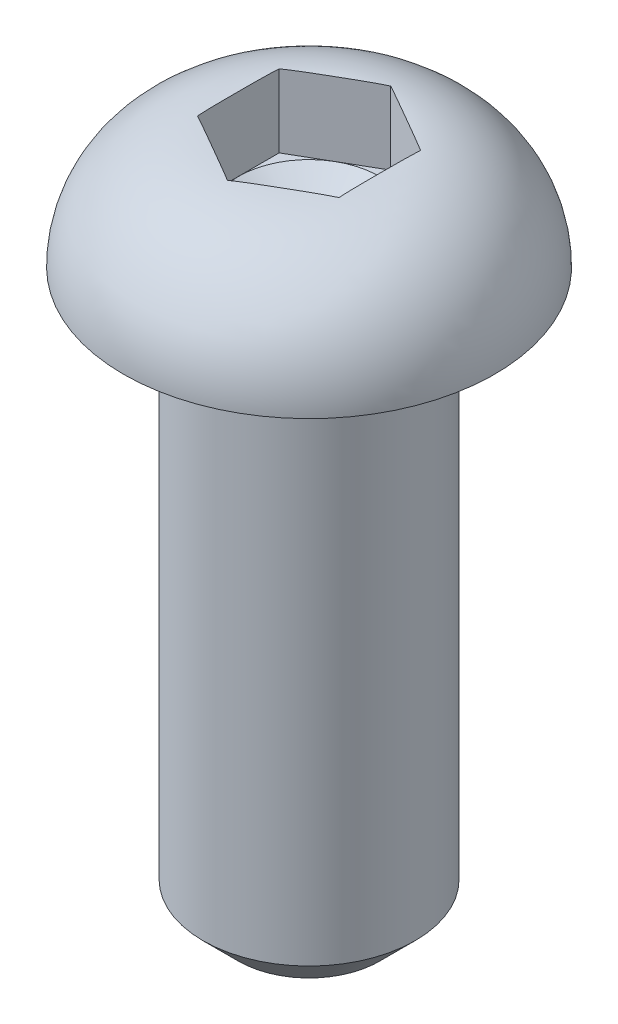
ISO-10303-21;
HEADER;
FILE_DESCRIPTION(('STEP AP214'),'2;1');
FILE_NAME('part.step','',(''),(''),'','','');
FILE_SCHEMA(('AUTOMOTIVE_DESIGN { 1 0 10303 214 1 1 1 1 }'));
ENDSEC;
DATA;
#1=APPLICATION_CONTEXT('core data for automotive mechanical design processes');
#2=APPLICATION_PROTOCOL_DEFINITION('international standard','automotive_design',2000,#1);
#3=PRODUCT_CONTEXT('',#1,'mechanical');
#4=PRODUCT('Part','Part','',(#3));
#5=PRODUCT_RELATED_PRODUCT_CATEGORY('part','',(#4));
#6=PRODUCT_DEFINITION_FORMATION('','',#4);
#7=PRODUCT_DEFINITION_CONTEXT('part definition',#1,'design');
#8=PRODUCT_DEFINITION('design','',#6,#7);
#9=PRODUCT_DEFINITION_SHAPE('','',#8);
#10=(LENGTH_UNIT() NAMED_UNIT(*) SI_UNIT(.MILLI.,.METRE.));
#11=(NAMED_UNIT(*) PLANE_ANGLE_UNIT() SI_UNIT($,.RADIAN.));
#12=(NAMED_UNIT(*) SI_UNIT($,.STERADIAN.) SOLID_ANGLE_UNIT());
#13=UNCERTAINTY_MEASURE_WITH_UNIT(LENGTH_MEASURE(1.E-05),#10,'distance_accuracy_value','');
#14=(GEOMETRIC_REPRESENTATION_CONTEXT(3) GLOBAL_UNCERTAINTY_ASSIGNED_CONTEXT((#13)) GLOBAL_UNIT_ASSIGNED_CONTEXT((#10,
#11,#12)) REPRESENTATION_CONTEXT('',''));
#15=CARTESIAN_POINT('',(0.,0.,0.));
#16=DIRECTION('',(0.,0.,1.));
#17=DIRECTION('',(1.,0.,0.));
#18=AXIS2_PLACEMENT_3D('',#15,#16,#17);
#19=CARTESIAN_POINT('',(-1.473312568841,-15.707490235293,0.698540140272));
#20=DIRECTION('',(0.,-1.,0.));
#21=DIRECTION('',(0.,0.,-1.));
#22=AXIS2_PLACEMENT_3D('',#19,#20,#21);
#23=PLANE('',#22);
#24=CARTESIAN_POINT('',(-1.473312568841,-15.707490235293,0.698540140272));
#25=DIRECTION('',(0.,-1.,0.));
#26=DIRECTION('',(0.,0.,1.));
#27=AXIS2_PLACEMENT_3D('',#24,#25,#26);
#28=CIRCLE('',#27,2.);
#29=CARTESIAN_POINT('',(-1.473312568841,-15.707490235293,2.698540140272));
#30=VERTEX_POINT('',#29);
#31=EDGE_CURVE('E10',#30,#30,#28,.T.);
#32=ORIENTED_EDGE('',*,*,#31,.T.);
#33=EDGE_LOOP('',(#32));
#34=FACE_BOUND('',#33,.T.);
#35=ADVANCED_FACE('F16',(#34),#23,.T.);
#36=CARTESIAN_POINT('',(-1.473312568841,-15.207490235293,0.698540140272));
#37=DIRECTION('',(0.,1.,0.));
#38=DIRECTION('',(0.,0.,-1.));
#39=AXIS2_PLACEMENT_3D('',#36,#37,#38);
#40=CONICAL_SURFACE('',#39,2.5,0.785398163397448);
#41=CARTESIAN_POINT('',(-1.473312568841,-14.707490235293,0.698540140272));
#42=DIRECTION('',(0.,-1.,0.));
#43=DIRECTION('',(0.,0.,1.));
#44=AXIS2_PLACEMENT_3D('',#41,#42,#43);
#45=CIRCLE('',#44,3.);
#46=CARTESIAN_POINT('',(-1.473312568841,-14.707490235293,3.698540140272));
#47=VERTEX_POINT('',#46);
#48=EDGE_CURVE('E25',#47,#47,#45,.T.);
#49=ORIENTED_EDGE('',*,*,#48,.T.);
#50=EDGE_LOOP('',(#49));
#51=FACE_BOUND('',#50,.T.);
#52=ORIENTED_EDGE('',*,*,#31,.F.);
#53=EDGE_LOOP('',(#52));
#54=FACE_BOUND('',#53,.T.);
#55=ADVANCED_FACE('F354',(#51,#54),#40,.T.);
#56=CARTESIAN_POINT('',(-1.473312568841,0.292509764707,0.698540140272));
#57=DIRECTION('',(0.,-1.,0.));
#58=DIRECTION('',(0.,0.,1.));
#59=AXIS2_PLACEMENT_3D('',#56,#57,#58);
#60=CYLINDRICAL_SURFACE('',#59,3.);
#61=CARTESIAN_POINT('',(-1.473312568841,0.042509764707,0.698540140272));
#62=DIRECTION('',(0.,-1.,0.));
#63=DIRECTION('',(0.,0.,1.));
#64=AXIS2_PLACEMENT_3D('',#61,#62,#63);
#65=CIRCLE('',#64,3.);
#66=CARTESIAN_POINT('',(-1.473312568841,0.042509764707,3.698540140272));
#67=VERTEX_POINT('',#66);
#68=EDGE_CURVE('E164',#67,#67,#65,.T.);
#69=ORIENTED_EDGE('',*,*,#68,.T.);
#70=EDGE_LOOP('',(#69));
#71=FACE_BOUND('',#70,.T.);
#72=ORIENTED_EDGE('',*,*,#48,.F.);
#73=EDGE_LOOP('',(#72));
#74=FACE_BOUND('',#73,.T.);
#75=ADVANCED_FACE('F359',(#71,#74),#60,.T.);
#76=CARTESIAN_POINT('',(-1.473312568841,0.042509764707,0.698540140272));
#77=DIRECTION('',(0.,-1.,0.));
#78=DIRECTION('',(0.,0.,1.));
#79=AXIS2_PLACEMENT_3D('',#76,#77,#78);
#80=TOROIDAL_SURFACE('',#79,3.25,0.25);
#81=CARTESIAN_POINT('',(-1.473312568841,0.292509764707,0.698540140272));
#82=DIRECTION('',(0.,-1.,0.));
#83=DIRECTION('',(0.,0.,1.));
#84=AXIS2_PLACEMENT_3D('',#81,#82,#83);
#85=CIRCLE('',#84,3.25);
#86=CARTESIAN_POINT('',(-1.473312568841,0.292509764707,3.948540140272));
#87=VERTEX_POINT('',#86);
#88=EDGE_CURVE('E165',#87,#87,#85,.T.);
#89=ORIENTED_EDGE('',*,*,#88,.T.);
#90=EDGE_LOOP('',(#89));
#91=FACE_BOUND('',#90,.T.);
#92=ORIENTED_EDGE('',*,*,#68,.F.);
#93=EDGE_LOOP('',(#92));
#94=FACE_BOUND('',#93,.T.);
#95=ADVANCED_FACE('F391',(#91,#94),#80,.F.);
#96=CARTESIAN_POINT('',(-1.473312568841,0.292509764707,0.698540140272));
#97=DIRECTION('',(0.,-1.,0.));
#98=DIRECTION('',(0.,0.,-1.));
#99=AXIS2_PLACEMENT_3D('',#96,#97,#98);
#100=PLANE('',#99);
#101=ORIENTED_EDGE('',*,*,#88,.F.);
#102=EDGE_LOOP('',(#101));
#103=FACE_BOUND('',#102,.T.);
#104=CARTESIAN_POINT('',(-1.473312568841,0.292509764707,0.698540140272));
#105=DIRECTION('',(0.,-1.,0.));
#106=DIRECTION('',(0.,0.,1.));
#107=AXIS2_PLACEMENT_3D('',#104,#105,#106);
#108=CIRCLE('',#107,5.25);
#109=CARTESIAN_POINT('',(-1.473312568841,0.292509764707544,5.948540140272));
#110=VERTEX_POINT('',#109);
#111=EDGE_CURVE('E128',#110,#110,#108,.T.);
#112=ORIENTED_EDGE('',*,*,#111,.T.);
#113=EDGE_LOOP('',(#112));
#114=FACE_BOUND('',#113,.T.);
#115=ADVANCED_FACE('F396',(#103,#114),#100,.T.);
#116=CARTESIAN_POINT('',(-1.473312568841,0.292509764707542,0.698540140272));
#117=DIRECTION('',(0.,-1.,0.));
#118=DIRECTION('',(0.,0.,1.));
#119=AXIS2_PLACEMENT_3D('',#116,#117,#118);
#120=DEGENERATE_TOROIDAL_SURFACE('',#119,1.95000000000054,3.29999999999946,.T.);
#121=CARTESIAN_POINT('',(0.52668743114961,3.57288030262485,1.85324067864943));
#122=CARTESIAN_POINT('',(0.50395887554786,3.57431799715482,1.86636301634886));
#123=CARTESIAN_POINT('',(0.45872047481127,3.57694780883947,1.89248141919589));
#124=CARTESIAN_POINT('',(0.39102821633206,3.58025582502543,1.9315635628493));
#125=CARTESIAN_POINT('',(0.32366460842,3.58298954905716,1.97045596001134));
#126=CARTESIAN_POINT('',(0.25643296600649,3.58522307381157,2.00927216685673));
#127=CARTESIAN_POINT('',(0.18702223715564,3.58708050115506,2.04934646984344));
#128=CARTESIAN_POINT('',(0.11309430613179,3.58862439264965,2.09202878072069));
#129=CARTESIAN_POINT('',(0.0228453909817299,3.59002196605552,2.14413401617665));
#130=CARTESIAN_POINT('',(-0.08109908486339,3.59106001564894,2.2041463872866));
#131=CARTESIAN_POINT('',(-0.19619270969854,3.59170078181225,2.27059572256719));
#132=CARTESIAN_POINT('',(-0.30515493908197,3.59200299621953,2.33350509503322));
#133=CARTESIAN_POINT('',(-0.39744455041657,3.59211331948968,2.38678852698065));
#134=CARTESIAN_POINT('',(-0.4600240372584,3.59213369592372,2.42291881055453));
#135=CARTESIAN_POINT('',(-0.517371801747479,3.59212641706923,2.45602855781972));
#136=CARTESIAN_POINT('',(-0.580095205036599,3.59208466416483,2.49224193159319));
#137=CARTESIAN_POINT('',(-0.6613487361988,3.59195025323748,2.53915367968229));
#138=CARTESIAN_POINT('',(-0.741936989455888,3.59170752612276,2.58568132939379));
#139=CARTESIAN_POINT('',(-0.815376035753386,3.59134622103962,2.62808138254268));
#140=CARTESIAN_POINT('',(-0.881760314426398,3.59086755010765,2.6664083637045));
#141=CARTESIAN_POINT('',(-0.941225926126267,3.59029424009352,2.70074085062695));
#142=CARTESIAN_POINT('',(-1.00053877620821,3.5895476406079,2.73498514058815));
#143=CARTESIAN_POINT('',(-1.05974912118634,3.58859477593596,2.76917024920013));
#144=CARTESIAN_POINT('',(-1.11893997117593,3.58739902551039,2.80334410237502));
#145=CARTESIAN_POINT('',(-1.17808805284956,3.58592335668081,2.83749326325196));
#146=CARTESIAN_POINT('',(-1.23710928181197,3.58413198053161,2.87156918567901));
#147=CARTESIAN_POINT('',(-1.29599394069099,3.58198776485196,2.90556625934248));
#148=CARTESIAN_POINT('',(-1.35487552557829,3.57944706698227,2.93956155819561));
#149=CARTESIAN_POINT('',(-1.41398005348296,3.57645683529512,2.97368557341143));
#150=CARTESIAN_POINT('',(-1.45348463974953,3.5741345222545,2.99649355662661));
#151=CARTESIAN_POINT('',(-1.473312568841,3.57288030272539,3.0079412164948));
#152=(BOUNDED_CURVE() B_SPLINE_CURVE(3,(#121,#122,#123,#124,#125,#126,#127,#128,#129,#130,#131,
#132,#133,#134,#135,#136,#137,#138,#139,#140,#141,#142,#143,#144,#145,#146,#147,#148,#149,#150,
#151),.UNSPECIFIED.,.F.,.F.) B_SPLINE_CURVE_WITH_KNOTS((4,1,1,1,1,1,1,1,1,1,1,1,1,1,1,1,1,1,1,1,
1,1,1,1,1,1,1,1,4),(-1.,-0.96587938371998,-0.932094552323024,-0.89840966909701,
-0.864799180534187,-0.831226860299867,-0.794285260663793,-0.753909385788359,-0.695866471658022,
-0.638392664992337,-0.581300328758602,-0.532463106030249,-0.499998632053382,-0.487460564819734,
-0.446468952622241,-0.405943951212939,-0.365618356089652,-0.325621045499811,-0.295811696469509,
-0.266061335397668,-0.236436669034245,-0.206853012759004,-0.177252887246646,-0.147652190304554,
-0.118125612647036,-0.0887070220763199,-0.0593007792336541,-0.0297668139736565,0.),
.UNSPECIFIED.) CURVE() GEOMETRIC_REPRESENTATION_ITEM() RATIONAL_B_SPLINE_CURVE((1.,1.,1.,1.,1.,
1.,1.,1.,1.,1.,1.,1.,1.,1.,1.,1.,1.,1.,1.,1.,1.,1.,1.,1.,1.,1.,1.,1.,1.,1.,1.)) REPRESENTATION_ITEM(''));
#153=CARTESIAN_POINT('',(0.526687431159,3.57288030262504,1.85324067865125));
#154=VERTEX_POINT('',#153);
#155=CARTESIAN_POINT('',(-1.473312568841,3.57288030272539,3.0079412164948));
#156=VERTEX_POINT('',#155);
#157=EDGE_CURVE('E115',#154,#156,#152,.T.);
#158=ORIENTED_EDGE('',*,*,#157,.T.);
#159=CARTESIAN_POINT('',(-1.473312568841,3.57288030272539,3.0079412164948));
#160=CARTESIAN_POINT('',(-1.49930551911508,3.57452446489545,2.99293418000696));
#161=CARTESIAN_POINT('',(-1.54669386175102,3.57724438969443,2.96557450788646));
#162=CARTESIAN_POINT('',(-1.61136203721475,3.58033769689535,2.92823831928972));
#163=CARTESIAN_POINT('',(-1.66780393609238,3.58263941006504,2.89565157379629));
#164=CARTESIAN_POINT('',(-1.72254887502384,3.58455185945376,2.86404456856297));
#165=CARTESIAN_POINT('',(-1.78116746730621,3.58626798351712,2.83020110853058));
#166=CARTESIAN_POINT('',(-1.84563780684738,3.5878028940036,2.79297914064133));
#167=CARTESIAN_POINT('',(-1.9149890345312,3.5890939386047,2.75293919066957));
#168=CARTESIAN_POINT('',(-1.99046837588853,3.5901463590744,2.70936117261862));
#169=CARTESIAN_POINT('',(-2.07143634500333,3.59094566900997,2.66261429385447));
#170=CARTESIAN_POINT('',(-2.159462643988,3.59151654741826,2.6117922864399));
#171=CARTESIAN_POINT('',(-2.25264269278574,3.59187609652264,2.55799476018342));
#172=CARTESIAN_POINT('',(-2.35078356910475,3.5920726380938,2.50133309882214));
#173=CARTESIAN_POINT('',(-2.42460405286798,3.5921263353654,2.45871282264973));
#174=CARTESIAN_POINT('',(-2.493521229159,3.59213400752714,2.41892347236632));
#175=CARTESIAN_POINT('',(-2.56411379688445,3.59210500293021,2.37816683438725));
#176=CARTESIAN_POINT('',(-2.66310210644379,3.59195989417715,2.32101590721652));
#177=CARTESIAN_POINT('',(-2.76994014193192,3.59161157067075,2.25933293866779));
#178=CARTESIAN_POINT('',(-2.87591146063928,3.59096579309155,2.19815036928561));
#179=CARTESIAN_POINT('',(-2.98021206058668,3.58989201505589,2.13793238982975));
#180=CARTESIAN_POINT('',(-3.08268055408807,3.58824546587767,2.07877217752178));
#181=CARTESIAN_POINT('',(-3.18291131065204,3.58588753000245,2.02090392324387));
#182=CARTESIAN_POINT('',(-3.28127518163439,3.58267093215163,1.96411351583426));
#183=CARTESIAN_POINT('',(-3.37778177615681,3.57846725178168,1.90839540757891));
#184=CARTESIAN_POINT('',(-3.4416346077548,3.57488401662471,1.87152995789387));
#185=CARTESIAN_POINT('',(-3.47331256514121,3.57288030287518,1.85324068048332));
#186=(BOUNDED_CURVE() B_SPLINE_CURVE(3,(#159,#160,#161,#162,#163,#164,#165,#166,#167,#168,#169,
#170,#171,#172,#173,#174,#175,#176,#177,#178,#179,#180,#181,#182,#183,#184,#185),.UNSPECIFIED.,
.F.,.F.) B_SPLINE_CURVE_WITH_KNOTS((4,1,1,1,1,1,1,1,1,1,1,1,1,1,1,1,1,1,1,1,1,1,1,1,4),(0.,
0.0390048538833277,0.0711123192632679,0.0970451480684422,0.123705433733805,0.153266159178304,
0.185007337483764,0.220437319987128,0.257302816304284,0.298208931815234,0.341849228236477,
0.389286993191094,0.437920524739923,0.489014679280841,0.499990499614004,0.54127223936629,
0.594879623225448,0.648437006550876,0.70148083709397,0.753789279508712,0.804852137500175,
0.85516576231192,0.904141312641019,0.952434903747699,1.),
.UNSPECIFIED.) CURVE() GEOMETRIC_REPRESENTATION_ITEM() RATIONAL_B_SPLINE_CURVE((1.,1.,1.,1.,1.,
1.,1.,1.,1.,1.,1.,1.,1.,1.,1.,1.,1.,1.,1.,1.,1.,1.,1.,1.,1.,1.,1.)) REPRESENTATION_ITEM(''));
#187=CARTESIAN_POINT('',(-3.473312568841,3.57288030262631,1.85324067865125));
#188=VERTEX_POINT('',#187);
#189=EDGE_CURVE('E120',#156,#188,#186,.T.);
#190=ORIENTED_EDGE('',*,*,#189,.T.);
#191=CARTESIAN_POINT('',(-3.47331256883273,3.57288030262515,1.85324067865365));
#192=CARTESIAN_POINT('',(-3.47331256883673,3.57323324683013,1.84679785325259));
#193=CARTESIAN_POINT('',(-3.47331256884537,3.57444412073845,1.82424537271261));
#194=CARTESIAN_POINT('',(-3.47331256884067,3.57577680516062,1.7975728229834));
#195=CARTESIAN_POINT('',(-3.47331256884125,3.57769538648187,1.75658858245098));
#196=CARTESIAN_POINT('',(-3.473312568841,3.57894443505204,1.72754217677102));
#197=CARTESIAN_POINT('',(-3.473312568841,3.58034958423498,1.69195308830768));
#198=CARTESIAN_POINT('',(-3.473312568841,3.5812636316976,1.66753115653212));
#199=CARTESIAN_POINT('',(-3.473312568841,3.58228054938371,1.63826545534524));
#200=CARTESIAN_POINT('',(-3.473312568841,3.58326058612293,1.60800596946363));
#201=CARTESIAN_POINT('',(-3.473312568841,3.58424381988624,1.57509591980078));
#202=CARTESIAN_POINT('',(-3.473312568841,3.58502540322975,1.54629131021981));
#203=CARTESIAN_POINT('',(-3.473312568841,3.58566018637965,1.52118460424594));
#204=CARTESIAN_POINT('',(-3.473312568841,3.5862197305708,1.49780436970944));
#205=CARTESIAN_POINT('',(-3.473312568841,3.5868647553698,1.46858496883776));
#206=CARTESIAN_POINT('',(-3.473312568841,3.58753158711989,1.43534184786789));
#207=CARTESIAN_POINT('',(-3.473312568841,3.58817496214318,1.39967684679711));
#208=CARTESIAN_POINT('',(-3.473312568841,3.5888932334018,1.35474166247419));
#209=CARTESIAN_POINT('',(-3.473312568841,3.58963515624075,1.29973488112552));
#210=CARTESIAN_POINT('',(-3.473312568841,3.59026641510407,1.2408741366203));
#211=CARTESIAN_POINT('',(-3.473312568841,3.59066209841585,1.19473451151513));
#212=CARTESIAN_POINT('',(-3.473312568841,3.59104616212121,1.14295863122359));
#213=CARTESIAN_POINT('',(-3.473312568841,3.59144454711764,1.07480911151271));
#214=CARTESIAN_POINT('',(-3.473312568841,3.59181857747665,0.975183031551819));
#215=CARTESIAN_POINT('',(-3.473312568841,3.5920414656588,0.865230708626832));
#216=CARTESIAN_POINT('',(-3.473312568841,3.59212006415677,0.771144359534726));
#217=CARTESIAN_POINT('',(-3.473312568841,3.59213278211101,0.706530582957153));
#218=CARTESIAN_POINT('',(-3.473312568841,3.59212861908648,0.667041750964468));
#219=CARTESIAN_POINT('',(-3.473312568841,3.59210530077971,0.602571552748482));
#220=CARTESIAN_POINT('',(-3.473312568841,3.59200545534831,0.503662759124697));
#221=CARTESIAN_POINT('',(-3.473312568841,3.59165590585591,0.362709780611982));
#222=CARTESIAN_POINT('',(-3.473312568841,3.59087015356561,0.21233431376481));
#223=CARTESIAN_POINT('',(-3.473312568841,3.58975658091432,0.104627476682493));
#224=CARTESIAN_POINT('',(-3.473312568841,3.58829371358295,0.00128660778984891));
#225=CARTESIAN_POINT('',(-3.47331256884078,3.58666821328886,-0.089421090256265));
#226=CARTESIAN_POINT('',(-3.47331256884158,3.58319960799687,-0.218458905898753));
#227=CARTESIAN_POINT('',(-3.47331256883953,3.58000957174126,-0.30589057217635));
#228=CARTESIAN_POINT('',(-3.47331256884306,3.57655568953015,-0.38525023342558));
#229=CARTESIAN_POINT('',(-3.47331256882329,3.57457741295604,-0.42518023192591));
#230=CARTESIAN_POINT('',(-3.4733125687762,3.57288030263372,-0.45616039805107));
#231=(BOUNDED_CURVE() B_SPLINE_CURVE(3,(#191,#192,#193,#194,#195,#196,#197,#198,#199,#200,#201,
#202,#203,#204,#205,#206,#207,#208,#209,#210,#211,#212,#213,#214,#215,#216,#217,#218,#219,#220,
#221,#222,#223,#224,#225,#226,#227,#228,#229,#230),.UNSPECIFIED.,.F.,
.F.) B_SPLINE_CURVE_WITH_KNOTS((4,1,1,1,1,1,1,1,1,1,1,1,1,1,1,1,1,1,1,1,1,1,1,1,1,1,1,1,1,1,1,1,
1,1,1,1,1,4),(0.,0.00838688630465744,0.0293500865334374,0.0346853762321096,0.0616603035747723,
0.067088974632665,0.080924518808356,0.0933909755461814,0.105116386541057,0.12024597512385,
0.136158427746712,0.142548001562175,0.152870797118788,0.166538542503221,0.180512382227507,
0.196057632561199,0.21286641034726,0.238876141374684,0.26749560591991,0.289303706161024,
0.298791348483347,0.334729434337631,0.377799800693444,0.428168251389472,0.477523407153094,
0.499994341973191,0.512087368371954,0.528810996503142,0.583727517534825,0.640548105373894,
0.711867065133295,0.779019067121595,0.780436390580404,0.846095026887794,0.896846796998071,
0.948089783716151,0.959718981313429,1.),
.UNSPECIFIED.) CURVE() GEOMETRIC_REPRESENTATION_ITEM() RATIONAL_B_SPLINE_CURVE((1.,1.,1.,1.,1.,
1.,1.,1.,1.,1.,1.,1.,1.,1.,1.,1.,1.,1.,1.,1.,1.,1.,1.,1.,1.,1.,1.,1.,1.,1.,1.,1.,1.,1.,1.,1.,1.,
1.,1.,1.)) REPRESENTATION_ITEM(''));
#232=CARTESIAN_POINT('',(-3.473312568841,3.57288030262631,-0.45616039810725));
#233=VERTEX_POINT('',#232);
#234=EDGE_CURVE('E150',#188,#233,#231,.T.);
#235=ORIENTED_EDGE('',*,*,#234,.T.);
#236=CARTESIAN_POINT('',(-3.47331256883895,3.57288030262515,-0.45616039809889));
#237=CARTESIAN_POINT('',(-3.4502369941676,3.5743401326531,-0.46948308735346));
#238=CARTESIAN_POINT('',(-3.40917274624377,3.57672393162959,-0.49319154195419));
#239=CARTESIAN_POINT('',(-3.35523236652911,3.57940235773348,-0.52433403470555));
#240=CARTESIAN_POINT('',(-3.31610155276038,3.58111845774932,-0.54692622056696));
#241=CARTESIAN_POINT('',(-3.28713856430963,3.58228054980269,-0.5636480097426));
#242=CARTESIAN_POINT('',(-3.26093308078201,3.58326058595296,-0.5787777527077));
#243=CARTESIAN_POINT('',(-3.23243214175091,3.58424382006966,-0.59523277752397));
#244=CARTESIAN_POINT('',(-3.20060720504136,3.58524094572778,-0.61360691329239));
#245=CARTESIAN_POINT('',(-3.16975459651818,3.58611116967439,-0.63141967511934));
#246=CARTESIAN_POINT('',(-3.14019095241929,3.58686475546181,-0.64848825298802));
#247=CARTESIAN_POINT('',(-3.11140156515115,3.58753158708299,-0.66510981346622));
#248=CARTESIAN_POINT('',(-3.08051476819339,3.58817496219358,-0.68294231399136));
#249=CARTESIAN_POINT('',(-3.04159975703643,3.58889323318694,-0.70540990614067));
#250=CARTESIAN_POINT('',(-2.99396248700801,3.58963515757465,-0.73291329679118));
#251=CARTESIAN_POINT('',(-2.93666041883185,3.59034476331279,-0.76599666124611));
#252=CARTESIAN_POINT('',(-2.87273438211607,3.59094797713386,-0.80290437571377));
#253=CARTESIAN_POINT('',(-2.79917105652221,3.59144455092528,-0.84537618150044));
#254=CARTESIAN_POINT('',(-2.71289234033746,3.59181857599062,-0.89518922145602));
#255=CARTESIAN_POINT('',(-2.61767083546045,3.59204146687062,-0.95016538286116));
#256=CARTESIAN_POINT('',(-2.5361896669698,3.59212006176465,-0.99720855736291));
#257=CARTESIAN_POINT('',(-2.46908119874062,3.5921353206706,-1.03595364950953));
#258=CARTESIAN_POINT('',(-2.39826495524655,3.59211470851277,-1.07683942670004));
#259=CARTESIAN_POINT('',(-2.30454380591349,3.59200545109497,-1.13094935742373));
#260=CARTESIAN_POINT('',(-2.18247494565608,3.59165591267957,-1.2014258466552));
#261=CARTESIAN_POINT('',(-2.05130083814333,3.59086442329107,-1.2771592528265));
#262=CARTESIAN_POINT('',(-1.91424320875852,3.58922001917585,-1.35628951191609));
#263=CARTESIAN_POINT('',(-1.79091812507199,3.58666823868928,-1.4274912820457));
#264=CARTESIAN_POINT('',(-1.67916809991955,3.58319958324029,-1.49201018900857));
#265=CARTESIAN_POINT('',(-1.57660712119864,3.57887874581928,-1.55122379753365));
#266=CARTESIAN_POINT('',(-1.50788793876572,3.5750672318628,-1.59089883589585));
#267=CARTESIAN_POINT('',(-1.47331256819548,3.57288030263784,-1.61086093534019));
#268=(BOUNDED_CURVE() B_SPLINE_CURVE(3,(#236,#237,#238,#239,#240,#241,#242,#243,#244,#245,#246,
#247,#248,#249,#250,#251,#252,#253,#254,#255,#256,#257,#258,#259,#260,#261,#262,#263,#264,#265,
#266,#267),.UNSPECIFIED.,.F.,.F.) B_SPLINE_CURVE_WITH_KNOTS((4,1,1,1,1,1,1,1,1,1,1,1,1,1,1,1,1,
1,1,1,1,1,1,1,1,1,1,1,1,4),(0.,0.0346853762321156,0.0616603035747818,0.0809245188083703,
0.0933909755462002,0.10511638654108,0.120245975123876,0.136158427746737,0.152870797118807,
0.166538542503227,0.180512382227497,0.196057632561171,0.212866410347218,0.238876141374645,
0.267495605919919,0.298791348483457,0.334729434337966,0.377799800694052,0.428168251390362,
0.477523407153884,0.499994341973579,0.528810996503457,0.583727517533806,0.640548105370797,
0.711867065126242,0.780436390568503,0.846095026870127,0.896846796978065,0.948089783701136,1.),
.UNSPECIFIED.) CURVE() GEOMETRIC_REPRESENTATION_ITEM() RATIONAL_B_SPLINE_CURVE((1.,1.,1.,1.,1.,
1.,1.,1.,1.,1.,1.,1.,1.,1.,1.,1.,1.,1.,1.,1.,1.,1.,1.,1.,1.,1.,1.,1.,1.,1.,1.,1.)) REPRESENTATION_ITEM(''));
#269=CARTESIAN_POINT('',(-1.473312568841,3.57288030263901,-1.6108609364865));
#270=VERTEX_POINT('',#269);
#271=EDGE_CURVE('E183',#233,#270,#268,.T.);
#272=ORIENTED_EDGE('',*,*,#271,.T.);
#273=CARTESIAN_POINT('',(-1.47331256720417,3.57288030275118,-1.61086093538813));
#274=CARTESIAN_POINT('',(-1.45023699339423,3.57434013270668,-1.59753824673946));
#275=CARTESIAN_POINT('',(-1.40917274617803,3.57672393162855,-1.57382979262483));
#276=CARTESIAN_POINT('',(-1.35523236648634,3.57940235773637,-1.54268729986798));
#277=CARTESIAN_POINT('',(-1.31610155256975,3.58111845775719,-1.52009511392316));
#278=CARTESIAN_POINT('',(-1.28713856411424,3.58228054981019,-1.50337332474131));
#279=CARTESIAN_POINT('',(-1.26093308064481,3.58326058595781,-1.48824358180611));
#280=CARTESIAN_POINT('',(-1.23243214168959,3.58424382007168,-1.47178855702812));
#281=CARTESIAN_POINT('',(-1.20060720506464,3.58524094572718,-1.45341442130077));
#282=CARTESIAN_POINT('',(-1.1697545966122,3.58611116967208,-1.43560165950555));
#283=CARTESIAN_POINT('',(-1.14019095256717,3.58686475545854,-1.41853308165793));
#284=CARTESIAN_POINT('',(-1.11140156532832,3.5875315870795,-1.40191152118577));
#285=CARTESIAN_POINT('',(-1.08051476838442,3.58817496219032,-1.3840790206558));
#286=CARTESIAN_POINT('',(-1.04159975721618,3.58889323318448,-1.3616114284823));
#287=CARTESIAN_POINT('',(-0.993962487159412,3.5896351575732,-1.33410803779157));
#288=CARTESIAN_POINT('',(-0.936660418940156,3.5903447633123,-1.30102467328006));
#289=CARTESIAN_POINT('',(-0.872734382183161,3.59094797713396,-1.26411695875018));
#290=CARTESIAN_POINT('',(-0.799171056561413,3.5914445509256,-1.22164515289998));
#291=CARTESIAN_POINT('',(-0.712892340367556,3.59181857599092,-1.17183211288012));
#292=CARTESIAN_POINT('',(-0.617670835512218,3.59204146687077,-1.11685595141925));
#293=CARTESIAN_POINT('',(-0.536189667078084,3.59212006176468,-1.06981277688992));
#294=CARTESIAN_POINT('',(-0.46908119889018,3.59213532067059,-1.03106768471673));
#295=CARTESIAN_POINT('',(-0.39826495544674,3.59211470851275,-0.99018190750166));
#296=CARTESIAN_POINT('',(-0.30454380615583,3.59200545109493,-0.9360719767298));
#297=CARTESIAN_POINT('',(-0.18247494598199,3.59165591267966,-0.86559548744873));
#298=CARTESIAN_POINT('',(-0.0513008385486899,3.59086442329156,-0.78986208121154));
#299=CARTESIAN_POINT('',(0.0857567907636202,3.58922001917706,-0.7107318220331));
#300=CARTESIAN_POINT('',(0.20908187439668,3.58666823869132,-0.63953005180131));
#301=CARTESIAN_POINT('',(0.32083189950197,3.58319958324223,-0.57501114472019));
#302=CARTESIAN_POINT('',(0.42339287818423,3.57887874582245,-0.51579753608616));
#303=CARTESIAN_POINT('',(0.49211206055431,3.57506723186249,-0.47612249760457));
#304=CARTESIAN_POINT('',(0.52668743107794,3.57288030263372,-0.45616039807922));
#305=(BOUNDED_CURVE() B_SPLINE_CURVE(3,(#273,#274,#275,#276,#277,#278,#279,#280,#281,#282,#283,
#284,#285,#286,#287,#288,#289,#290,#291,#292,#293,#294,#295,#296,#297,#298,#299,#300,#301,#302,
#303,#304),.UNSPECIFIED.,.F.,.F.) B_SPLINE_CURVE_WITH_KNOTS((4,1,1,1,1,1,1,1,1,1,1,1,1,1,1,1,1,
1,1,1,1,1,1,1,1,1,1,1,1,4),(0.,0.0346853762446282,0.0616603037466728,0.0809245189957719,
0.0933909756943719,0.105116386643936,0.120245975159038,0.136158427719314,0.152870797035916,
0.166538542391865,0.180512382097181,0.196057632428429,0.212866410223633,0.238876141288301,
0.267495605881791,0.298791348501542,0.334729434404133,0.37779980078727,0.428168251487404,
0.477523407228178,0.499994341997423,0.52881099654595,0.583727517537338,0.640548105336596,
0.711867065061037,0.780436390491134,0.84609502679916,0.896846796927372,0.948089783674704,1.),
.UNSPECIFIED.) CURVE() GEOMETRIC_REPRESENTATION_ITEM() RATIONAL_B_SPLINE_CURVE((1.,1.,1.,1.,1.,
1.,1.,1.,1.,1.,1.,1.,1.,1.,1.,1.,1.,1.,1.,1.,1.,1.,1.,1.,1.,1.,1.,1.,1.,1.,1.,1.)) REPRESENTATION_ITEM(''));
#306=CARTESIAN_POINT('',(0.526687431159,3.57288030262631,-0.45616039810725));
#307=VERTEX_POINT('',#306);
#308=EDGE_CURVE('E178',#270,#307,#305,.T.);
#309=ORIENTED_EDGE('',*,*,#308,.T.);
#310=CARTESIAN_POINT('',(0.52668743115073,3.57288030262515,-0.45616039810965));
#311=CARTESIAN_POINT('',(0.52668743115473,3.57323324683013,-0.44971757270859));
#312=CARTESIAN_POINT('',(0.52668743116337,3.57444412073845,-0.42716509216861));
#313=CARTESIAN_POINT('',(0.52668743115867,3.57577680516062,-0.40049254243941));
#314=CARTESIAN_POINT('',(0.52668743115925,3.57769538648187,-0.35950830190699));
#315=CARTESIAN_POINT('',(0.526687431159,3.57894443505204,-0.33046189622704));
#316=CARTESIAN_POINT('',(0.526687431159,3.58034958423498,-0.294872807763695));
#317=CARTESIAN_POINT('',(0.526687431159,3.5812636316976,-0.270450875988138));
#318=CARTESIAN_POINT('',(0.526687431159,3.58228054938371,-0.241185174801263));
#319=CARTESIAN_POINT('',(0.526687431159,3.58326058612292,-0.210925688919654));
#320=CARTESIAN_POINT('',(0.526687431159,3.58424381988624,-0.178015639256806));
#321=CARTESIAN_POINT('',(0.526687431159,3.58502540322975,-0.14921102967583));
#322=CARTESIAN_POINT('',(0.526687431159,3.58566018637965,-0.124104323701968));
#323=CARTESIAN_POINT('',(0.526687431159,3.5862197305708,-0.100724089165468));
#324=CARTESIAN_POINT('',(0.526687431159,3.5868647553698,-0.071504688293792));
#325=CARTESIAN_POINT('',(0.526687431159,3.58753158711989,-0.0382615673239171));
#326=CARTESIAN_POINT('',(0.526687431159,3.58817496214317,-0.00259656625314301));
#327=CARTESIAN_POINT('',(0.526687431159,3.5888932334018,0.04233861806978));
#328=CARTESIAN_POINT('',(0.526687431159,3.58963515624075,0.097345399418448));
#329=CARTESIAN_POINT('',(0.526687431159,3.59026641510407,0.156206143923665));
#330=CARTESIAN_POINT('',(0.526687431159,3.59066209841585,0.202345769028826));
#331=CARTESIAN_POINT('',(0.526687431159,3.59104616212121,0.254121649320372));
#332=CARTESIAN_POINT('',(0.526687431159,3.59144454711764,0.322271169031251));
#333=CARTESIAN_POINT('',(0.526687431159,3.59181857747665,0.421897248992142));
#334=CARTESIAN_POINT('',(0.526687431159,3.5920414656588,0.53184957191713));
#335=CARTESIAN_POINT('',(0.526687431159,3.59212006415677,0.625935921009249));
#336=CARTESIAN_POINT('',(0.526687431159,3.59213278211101,0.690549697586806));
#337=CARTESIAN_POINT('',(0.526687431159,3.59212861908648,0.730038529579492));
#338=CARTESIAN_POINT('',(0.526687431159,3.59210530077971,0.794508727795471));
#339=CARTESIAN_POINT('',(0.526687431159,3.59200545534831,0.893417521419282));
#340=CARTESIAN_POINT('',(0.526687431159,3.59165590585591,1.03437049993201));
#341=CARTESIAN_POINT('',(0.526687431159,3.5908701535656,1.18474596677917));
#342=CARTESIAN_POINT('',(0.526687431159,3.58975658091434,1.29245280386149));
#343=CARTESIAN_POINT('',(0.526687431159,3.58829371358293,1.39579367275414));
#344=CARTESIAN_POINT('',(0.52668743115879,3.58666821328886,1.48650137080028));
#345=CARTESIAN_POINT('',(0.52668743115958,3.58319960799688,1.61553918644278));
#346=CARTESIAN_POINT('',(0.52668743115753,3.58000957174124,1.70297085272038));
#347=CARTESIAN_POINT('',(0.52668743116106,3.57655568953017,1.7823305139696));
#348=CARTESIAN_POINT('',(0.52668743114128,3.57457741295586,1.82226051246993));
#349=CARTESIAN_POINT('',(0.52668743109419,3.57288030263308,1.85324067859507));
#350=(BOUNDED_CURVE() B_SPLINE_CURVE(3,(#310,#311,#312,#313,#314,#315,#316,#317,#318,#319,#320,
#321,#322,#323,#324,#325,#326,#327,#328,#329,#330,#331,#332,#333,#334,#335,#336,#337,#338,#339,
#340,#341,#342,#343,#344,#345,#346,#347,#348,#349),.UNSPECIFIED.,.F.,
.F.) B_SPLINE_CURVE_WITH_KNOTS((4,1,1,1,1,1,1,1,1,1,1,1,1,1,1,1,1,1,1,1,1,1,1,1,1,1,1,1,1,1,1,1,
1,1,1,1,1,4),(0.,0.00838688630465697,0.029350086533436,0.0346853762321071,0.061660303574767,
0.0670889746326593,0.0809245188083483,0.0933909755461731,0.105116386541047,0.120245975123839,
0.1361584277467,0.142548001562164,0.152870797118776,0.166538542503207,0.180512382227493,
0.196057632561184,0.212866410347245,0.238876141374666,0.267495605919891,0.289303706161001,
0.298791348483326,0.334729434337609,0.37779980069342,0.428168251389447,0.477523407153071,
0.499994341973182,0.512087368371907,0.528810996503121,0.583727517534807,0.640548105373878,
0.711867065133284,0.77901906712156,0.780436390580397,0.846095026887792,0.896846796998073,
0.948089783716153,0.959718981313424,1.),
.UNSPECIFIED.) CURVE() GEOMETRIC_REPRESENTATION_ITEM() RATIONAL_B_SPLINE_CURVE((1.,1.,1.,1.,1.,
1.,1.,1.,1.,1.,1.,1.,1.,1.,1.,1.,1.,1.,1.,1.,1.,1.,1.,1.,1.,1.,1.,1.,1.,1.,1.,1.,1.,1.,1.,1.,1.,
1.,1.,1.)) REPRESENTATION_ITEM(''));
#351=EDGE_CURVE('E124',#307,#154,#350,.T.);
#352=ORIENTED_EDGE('',*,*,#351,.T.);
#353=EDGE_LOOP('',(#158,#190,#235,#272,#309,#352));
#354=FACE_BOUND('',#353,.T.);
#355=ORIENTED_EDGE('',*,*,#111,.F.);
#356=EDGE_LOOP('',(#355));
#357=FACE_BOUND('',#356,.T.);
#358=ADVANCED_FACE('F117',(#354,#357),#120,.T.);
#359=CARTESIAN_POINT('',(-1.473312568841,1.512509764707,3.0079412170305));
#360=DIRECTION('',(0.5,0.,0.866025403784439));
#361=DIRECTION('',(0.,-1.,0.));
#362=AXIS2_PLACEMENT_3D('',#359,#360,#361);
#363=PLANE('',#362);
#364=ORIENTED_EDGE('',*,*,#157,.F.);
#365=DIRECTION('',(0.,1.,0.));
#366=VECTOR('',#365,1.);
#367=CARTESIAN_POINT('',(0.526687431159,1.512509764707,1.85324067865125));
#368=LINE('',#367,#366);
#369=CARTESIAN_POINT('',(0.526687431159,1.512509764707,1.85324067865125));
#370=VERTEX_POINT('',#369);
#371=EDGE_CURVE('E175',#370,#154,#368,.T.);
#372=ORIENTED_EDGE('',*,*,#371,.F.);
#373=DIRECTION('',(0.866025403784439,0.,-0.5));
#374=VECTOR('',#373,1.);
#375=CARTESIAN_POINT('',(-0.473312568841,1.512509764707,2.43059094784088));
#376=LINE('',#375,#374);
#377=CARTESIAN_POINT('',(-0.473312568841,1.512509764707,2.43059094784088));
#378=VERTEX_POINT('',#377);
#379=EDGE_CURVE('E214',#378,#370,#376,.T.);
#380=ORIENTED_EDGE('',*,*,#379,.F.);
#381=DIRECTION('',(0.866025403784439,0.,-0.5));
#382=VECTOR('',#381,1.);
#383=CARTESIAN_POINT('',(-1.473312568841,1.512509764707,3.0079412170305));
#384=LINE('',#383,#382);
#385=CARTESIAN_POINT('',(-1.473312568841,1.512509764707,3.0079412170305));
#386=VERTEX_POINT('',#385);
#387=EDGE_CURVE('E135',#386,#378,#384,.T.);
#388=ORIENTED_EDGE('',*,*,#387,.F.);
#389=DIRECTION('',(0.,1.,0.));
#390=VECTOR('',#389,1.);
#391=CARTESIAN_POINT('',(-1.473312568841,1.512509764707,3.0079412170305));
#392=LINE('',#391,#390);
#393=EDGE_CURVE('E129',#386,#156,#392,.T.);
#394=ORIENTED_EDGE('',*,*,#393,.T.);
#395=EDGE_LOOP('',(#364,#372,#380,#388,#394));
#396=FACE_BOUND('',#395,.T.);
#397=ADVANCED_FACE('F132',(#396),#363,.F.);
#398=CARTESIAN_POINT('',(-3.473312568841,1.512509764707,1.85324067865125));
#399=DIRECTION('',(-0.5,0.,0.866025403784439));
#400=DIRECTION('',(0.,1.,0.));
#401=AXIS2_PLACEMENT_3D('',#398,#399,#400);
#402=PLANE('',#401);
#403=ORIENTED_EDGE('',*,*,#189,.F.);
#404=ORIENTED_EDGE('',*,*,#393,.F.);
#405=DIRECTION('',(0.866025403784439,0.,0.5));
#406=VECTOR('',#405,1.);
#407=CARTESIAN_POINT('',(-2.473312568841,1.512509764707,2.43059094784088));
#408=LINE('',#407,#406);
#409=CARTESIAN_POINT('',(-2.473312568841,1.512509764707,2.43059094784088));
#410=VERTEX_POINT('',#409);
#411=EDGE_CURVE('E228',#410,#386,#408,.T.);
#412=ORIENTED_EDGE('',*,*,#411,.F.);
#413=DIRECTION('',(0.866025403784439,0.,0.5));
#414=VECTOR('',#413,1.);
#415=CARTESIAN_POINT('',(-3.473312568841,1.512509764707,1.85324067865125));
#416=LINE('',#415,#414);
#417=CARTESIAN_POINT('',(-3.473312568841,1.512509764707,1.85324067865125));
#418=VERTEX_POINT('',#417);
#419=EDGE_CURVE('E169',#418,#410,#416,.T.);
#420=ORIENTED_EDGE('',*,*,#419,.F.);
#421=DIRECTION('',(0.,1.,0.));
#422=VECTOR('',#421,1.);
#423=CARTESIAN_POINT('',(-3.473312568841,1.512509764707,1.85324067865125));
#424=LINE('',#423,#422);
#425=EDGE_CURVE('E142',#418,#188,#424,.T.);
#426=ORIENTED_EDGE('',*,*,#425,.T.);
#427=EDGE_LOOP('',(#403,#404,#412,#420,#426));
#428=FACE_BOUND('',#427,.T.);
#429=ADVANCED_FACE('F140',(#428),#402,.F.);
#430=CARTESIAN_POINT('',(-3.473312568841,1.512509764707,-0.45616039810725));
#431=DIRECTION('',(-1.,0.,0.));
#432=DIRECTION('',(0.,0.,1.));
#433=AXIS2_PLACEMENT_3D('',#430,#431,#432);
#434=PLANE('',#433);
#435=ORIENTED_EDGE('',*,*,#234,.F.);
#436=ORIENTED_EDGE('',*,*,#425,.F.);
#437=DIRECTION('',(0.,0.,1.));
#438=VECTOR('',#437,1.);
#439=CARTESIAN_POINT('',(-3.473312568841,1.512509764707,0.698540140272));
#440=LINE('',#439,#438);
#441=CARTESIAN_POINT('',(-3.473312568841,1.512509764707,0.698540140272));
#442=VERTEX_POINT('',#441);
#443=EDGE_CURVE('E174',#442,#418,#440,.T.);
#444=ORIENTED_EDGE('',*,*,#443,.F.);
#445=DIRECTION('',(0.,0.,1.));
#446=VECTOR('',#445,1.);
#447=CARTESIAN_POINT('',(-3.473312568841,1.512509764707,-0.45616039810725));
#448=LINE('',#447,#446);
#449=CARTESIAN_POINT('',(-3.473312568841,1.512509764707,-0.45616039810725));
#450=VERTEX_POINT('',#449);
#451=EDGE_CURVE('E186',#450,#442,#448,.T.);
#452=ORIENTED_EDGE('',*,*,#451,.F.);
#453=DIRECTION('',(0.,1.,0.));
#454=VECTOR('',#453,1.);
#455=CARTESIAN_POINT('',(-3.473312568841,1.512509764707,-0.45616039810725));
#456=LINE('',#455,#454);
#457=EDGE_CURVE('E309',#450,#233,#456,.T.);
#458=ORIENTED_EDGE('',*,*,#457,.T.);
#459=EDGE_LOOP('',(#435,#436,#444,#452,#458));
#460=FACE_BOUND('',#459,.T.);
#461=ADVANCED_FACE('F339',(#460),#434,.F.);
#462=CARTESIAN_POINT('',(-1.473312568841,1.512509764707,-1.6108609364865));
#463=DIRECTION('',(-0.5,0.,-0.866025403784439));
#464=DIRECTION('',(-0.866025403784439,0.,0.5));
#465=AXIS2_PLACEMENT_3D('',#462,#463,#464);
#466=PLANE('',#465);
#467=ORIENTED_EDGE('',*,*,#271,.F.);
#468=ORIENTED_EDGE('',*,*,#457,.F.);
#469=DIRECTION('',(-0.866025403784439,0.,0.5));
#470=VECTOR('',#469,1.);
#471=CARTESIAN_POINT('',(-2.473312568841,1.512509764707,-1.03351066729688));
#472=LINE('',#471,#470);
#473=CARTESIAN_POINT('',(-2.473312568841,1.512509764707,-1.03351066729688));
#474=VERTEX_POINT('',#473);
#475=EDGE_CURVE('E193',#474,#450,#472,.T.);
#476=ORIENTED_EDGE('',*,*,#475,.F.);
#477=DIRECTION('',(-0.866025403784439,0.,0.5));
#478=VECTOR('',#477,1.);
#479=CARTESIAN_POINT('',(-1.473312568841,1.512509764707,-1.6108609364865));
#480=LINE('',#479,#478);
#481=CARTESIAN_POINT('',(-1.473312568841,1.512509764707,-1.6108609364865));
#482=VERTEX_POINT('',#481);
#483=EDGE_CURVE('E210',#482,#474,#480,.T.);
#484=ORIENTED_EDGE('',*,*,#483,.F.);
#485=DIRECTION('',(0.,1.,0.));
#486=VECTOR('',#485,1.);
#487=CARTESIAN_POINT('',(-1.473312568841,1.512509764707,-1.6108609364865));
#488=LINE('',#487,#486);
#489=EDGE_CURVE('E180',#482,#270,#488,.T.);
#490=ORIENTED_EDGE('',*,*,#489,.T.);
#491=EDGE_LOOP('',(#467,#468,#476,#484,#490));
#492=FACE_BOUND('',#491,.T.);
#493=ADVANCED_FACE('F345',(#492),#466,.F.);
#494=CARTESIAN_POINT('',(0.526687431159,1.512509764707,-0.45616039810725));
#495=DIRECTION('',(0.5,0.,-0.866025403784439));
#496=DIRECTION('',(0.,-1.,0.));
#497=AXIS2_PLACEMENT_3D('',#494,#495,#496);
#498=PLANE('',#497);
#499=ORIENTED_EDGE('',*,*,#308,.F.);
#500=ORIENTED_EDGE('',*,*,#489,.F.);
#501=DIRECTION('',(-0.866025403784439,0.,-0.5));
#502=VECTOR('',#501,1.);
#503=CARTESIAN_POINT('',(-0.473312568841,1.512509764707,-1.03351066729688));
#504=LINE('',#503,#502);
#505=CARTESIAN_POINT('',(-0.473312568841,1.512509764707,-1.03351066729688));
#506=VERTEX_POINT('',#505);
#507=EDGE_CURVE('E221',#506,#482,#504,.T.);
#508=ORIENTED_EDGE('',*,*,#507,.F.);
#509=DIRECTION('',(-0.866025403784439,0.,-0.5));
#510=VECTOR('',#509,1.);
#511=CARTESIAN_POINT('',(0.526687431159,1.512509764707,-0.45616039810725));
#512=LINE('',#511,#510);
#513=CARTESIAN_POINT('',(0.526687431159,1.512509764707,-0.45616039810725));
#514=VERTEX_POINT('',#513);
#515=EDGE_CURVE('E222',#514,#506,#512,.T.);
#516=ORIENTED_EDGE('',*,*,#515,.F.);
#517=DIRECTION('',(0.,1.,0.));
#518=VECTOR('',#517,1.);
#519=CARTESIAN_POINT('',(0.526687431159,1.512509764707,-0.45616039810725));
#520=LINE('',#519,#518);
#521=EDGE_CURVE('E179',#514,#307,#520,.T.);
#522=ORIENTED_EDGE('',*,*,#521,.T.);
#523=EDGE_LOOP('',(#499,#500,#508,#516,#522));
#524=FACE_BOUND('',#523,.T.);
#525=ADVANCED_FACE('F266',(#524),#498,.F.);
#526=CARTESIAN_POINT('',(0.526687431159,1.512509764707,1.85324067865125));
#527=DIRECTION('',(1.,0.,0.));
#528=DIRECTION('',(0.,1.,0.));
#529=AXIS2_PLACEMENT_3D('',#526,#527,#528);
#530=PLANE('',#529);
#531=ORIENTED_EDGE('',*,*,#351,.F.);
#532=ORIENTED_EDGE('',*,*,#521,.F.);
#533=DIRECTION('',(0.,0.,-1.));
#534=VECTOR('',#533,1.);
#535=CARTESIAN_POINT('',(0.526687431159,1.512509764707,0.698540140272));
#536=LINE('',#535,#534);
#537=CARTESIAN_POINT('',(0.526687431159,1.512509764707,0.698540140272));
#538=VERTEX_POINT('',#537);
#539=EDGE_CURVE('E227',#538,#514,#536,.T.);
#540=ORIENTED_EDGE('',*,*,#539,.F.);
#541=DIRECTION('',(0.,0.,-1.));
#542=VECTOR('',#541,1.);
#543=CARTESIAN_POINT('',(0.526687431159,1.512509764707,1.85324067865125));
#544=LINE('',#543,#542);
#545=EDGE_CURVE('E246',#370,#538,#544,.T.);
#546=ORIENTED_EDGE('',*,*,#545,.F.);
#547=ORIENTED_EDGE('',*,*,#371,.T.);
#548=EDGE_LOOP('',(#531,#532,#540,#546,#547));
#549=FACE_BOUND('',#548,.T.);
#550=ADVANCED_FACE('F269',(#549),#530,.F.);
#551=CARTESIAN_POINT('',(-1.473312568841,0.935159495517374,0.698540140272));
#552=DIRECTION('',(0.,1.,0.));
#553=DIRECTION('',(1.,0.,0.));
#554=AXIS2_PLACEMENT_3D('',#551,#552,#553);
#555=CONICAL_SURFACE('',#554,1.,1.0471975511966);
#556=CARTESIAN_POINT('',(-1.473312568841,0.357809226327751,0.698540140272));
#557=VERTEX_POINT('',#556);
#558=VERTEX_LOOP('',#557);
#559=FACE_BOUND('',#558,.T.);
#560=CARTESIAN_POINT('',(-1.473312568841,1.512509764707,0.698540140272));
#561=DIRECTION('',(0.,-1.,0.));
#562=DIRECTION('',(1.,0.,0.));
#563=AXIS2_PLACEMENT_3D('',#560,#561,#562);
#564=CIRCLE('',#563,2.);
#565=EDGE_CURVE('E237',#506,#538,#564,.T.);
#566=ORIENTED_EDGE('',*,*,#565,.F.);
#567=CARTESIAN_POINT('',(-1.473312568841,1.512509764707,0.698540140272));
#568=DIRECTION('',(0.,-1.,0.));
#569=DIRECTION('',(0.5,0.,-0.866025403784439));
#570=AXIS2_PLACEMENT_3D('',#567,#568,#569);
#571=CIRCLE('',#570,2.);
#572=EDGE_CURVE('E226',#474,#506,#571,.T.);
#573=ORIENTED_EDGE('',*,*,#572,.F.);
#574=CARTESIAN_POINT('',(-1.473312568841,1.512509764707,0.698540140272));
#575=DIRECTION('',(0.,-1.,0.));
#576=DIRECTION('',(-0.5,0.,-0.866025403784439));
#577=AXIS2_PLACEMENT_3D('',#574,#575,#576);
#578=CIRCLE('',#577,2.);
#579=EDGE_CURVE('E205',#442,#474,#578,.T.);
#580=ORIENTED_EDGE('',*,*,#579,.F.);
#581=CARTESIAN_POINT('',(-1.473312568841,1.512509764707,0.698540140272));
#582=DIRECTION('',(0.,-1.,0.));
#583=DIRECTION('',(-1.,0.,0.));
#584=AXIS2_PLACEMENT_3D('',#581,#582,#583);
#585=CIRCLE('',#584,2.);
#586=EDGE_CURVE('E192',#410,#442,#585,.T.);
#587=ORIENTED_EDGE('',*,*,#586,.F.);
#588=CARTESIAN_POINT('',(-1.473312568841,1.512509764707,0.698540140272));
#589=DIRECTION('',(0.,-1.,0.));
#590=DIRECTION('',(-0.5,0.,0.866025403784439));
#591=AXIS2_PLACEMENT_3D('',#588,#589,#590);
#592=CIRCLE('',#591,2.);
#593=EDGE_CURVE('E173',#378,#410,#592,.T.);
#594=ORIENTED_EDGE('',*,*,#593,.F.);
#595=CARTESIAN_POINT('',(-1.473312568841,1.512509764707,0.698540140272));
#596=DIRECTION('',(0.,-1.,0.));
#597=DIRECTION('',(0.5,0.,0.866025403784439));
#598=AXIS2_PLACEMENT_3D('',#595,#596,#597);
#599=CIRCLE('',#598,2.);
#600=EDGE_CURVE('E238',#538,#378,#599,.T.);
#601=ORIENTED_EDGE('',*,*,#600,.F.);
#602=EDGE_LOOP('',(#566,#573,#580,#587,#594,#601));
#603=FACE_BOUND('',#602,.T.);
#604=ADVANCED_FACE('F287',(#559,#603),#555,.F.);
#605=CARTESIAN_POINT('',(-1.473312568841,1.512509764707,0.698540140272));
#606=DIRECTION('',(0.,1.,0.));
#607=DIRECTION('',(1.,0.,0.));
#608=AXIS2_PLACEMENT_3D('',#605,#606,#607);
#609=PLANE('',#608);
#610=ORIENTED_EDGE('',*,*,#600,.T.);
#611=ORIENTED_EDGE('',*,*,#379,.T.);
#612=ORIENTED_EDGE('',*,*,#545,.T.);
#613=EDGE_LOOP('',(#610,#611,#612));
#614=FACE_BOUND('',#613,.T.);
#615=ADVANCED_FACE('F277',(#614),#609,.T.);
#616=CARTESIAN_POINT('',(-1.473312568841,1.512509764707,0.698540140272));
#617=DIRECTION('',(0.,1.,0.));
#618=DIRECTION('',(1.,0.,0.));
#619=AXIS2_PLACEMENT_3D('',#616,#617,#618);
#620=PLANE('',#619);
#621=ORIENTED_EDGE('',*,*,#593,.T.);
#622=ORIENTED_EDGE('',*,*,#411,.T.);
#623=ORIENTED_EDGE('',*,*,#387,.T.);
#624=EDGE_LOOP('',(#621,#622,#623));
#625=FACE_BOUND('',#624,.T.);
#626=ADVANCED_FACE('F283',(#625),#620,.T.);
#627=CARTESIAN_POINT('',(-1.473312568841,1.512509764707,0.698540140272));
#628=DIRECTION('',(0.,1.,0.));
#629=DIRECTION('',(1.,0.,0.));
#630=AXIS2_PLACEMENT_3D('',#627,#628,#629);
#631=PLANE('',#630);
#632=ORIENTED_EDGE('',*,*,#586,.T.);
#633=ORIENTED_EDGE('',*,*,#443,.T.);
#634=ORIENTED_EDGE('',*,*,#419,.T.);
#635=EDGE_LOOP('',(#632,#633,#634));
#636=FACE_BOUND('',#635,.T.);
#637=ADVANCED_FACE('F414',(#636),#631,.T.);
#638=CARTESIAN_POINT('',(-1.473312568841,1.512509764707,0.698540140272));
#639=DIRECTION('',(0.,1.,0.));
#640=DIRECTION('',(1.,0.,0.));
#641=AXIS2_PLACEMENT_3D('',#638,#639,#640);
#642=PLANE('',#641);
#643=ORIENTED_EDGE('',*,*,#579,.T.);
#644=ORIENTED_EDGE('',*,*,#475,.T.);
#645=ORIENTED_EDGE('',*,*,#451,.T.);
#646=EDGE_LOOP('',(#643,#644,#645));
#647=FACE_BOUND('',#646,.T.);
#648=ADVANCED_FACE('F18',(#647),#642,.T.);
#649=CARTESIAN_POINT('',(-1.473312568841,1.512509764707,0.698540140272));
#650=DIRECTION('',(0.,1.,0.));
#651=DIRECTION('',(1.,0.,0.));
#652=AXIS2_PLACEMENT_3D('',#649,#650,#651);
#653=PLANE('',#652);
#654=ORIENTED_EDGE('',*,*,#572,.T.);
#655=ORIENTED_EDGE('',*,*,#507,.T.);
#656=ORIENTED_EDGE('',*,*,#483,.T.);
#657=EDGE_LOOP('',(#654,#655,#656));
#658=FACE_BOUND('',#657,.T.);
#659=ADVANCED_FACE('F383',(#658),#653,.T.);
#660=CARTESIAN_POINT('',(-1.473312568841,1.512509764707,0.698540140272));
#661=DIRECTION('',(0.,1.,0.));
#662=DIRECTION('',(1.,0.,0.));
#663=AXIS2_PLACEMENT_3D('',#660,#661,#662);
#664=PLANE('',#663);
#665=ORIENTED_EDGE('',*,*,#565,.T.);
#666=ORIENTED_EDGE('',*,*,#539,.T.);
#667=ORIENTED_EDGE('',*,*,#515,.T.);
#668=EDGE_LOOP('',(#665,#666,#667));
#669=FACE_BOUND('',#668,.T.);
#670=ADVANCED_FACE('F378',(#669),#664,.T.);
#671=CLOSED_SHELL('',(#35,#55,#75,#95,#115,#358,#397,#429,#461,#493,#525,#550,#604,#615,#626,
#637,#648,#659,#670));
#672=MANIFOLD_SOLID_BREP('B1',#671);
#673=ADVANCED_BREP_SHAPE_REPRESENTATION('',(#18,#672),#14);
#674=SHAPE_DEFINITION_REPRESENTATION(#9,#673);
ENDSEC;
END-ISO-10303-21;
